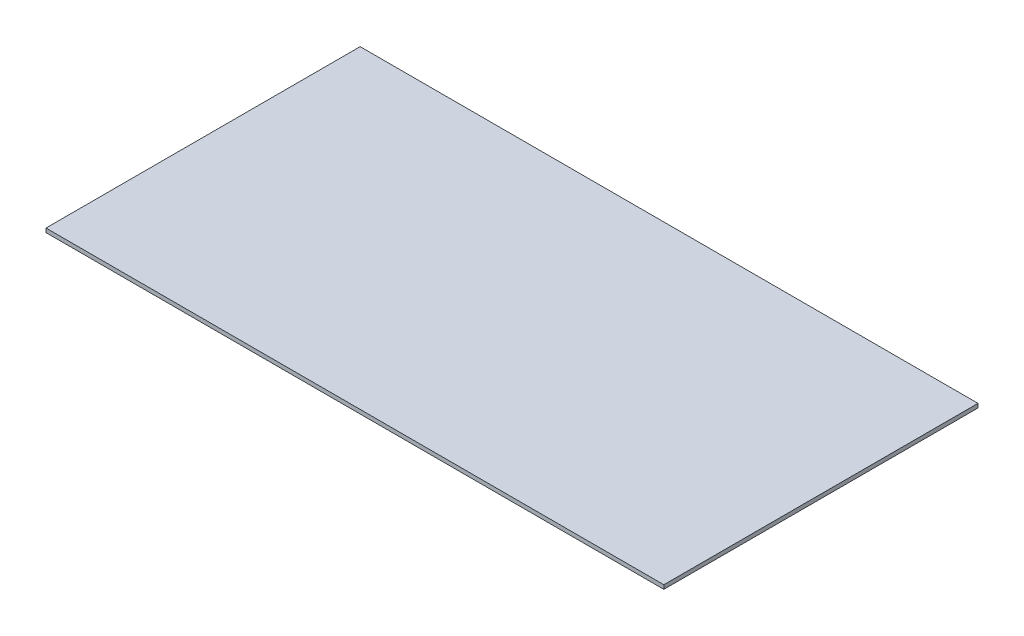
ISO-10303-21;
HEADER;
FILE_DESCRIPTION(('STEP AP214'),'2;1');
FILE_NAME('part.step','',(''),(''),'','','');
FILE_SCHEMA(('AUTOMOTIVE_DESIGN { 1 0 10303 214 1 1 1 1 }'));
ENDSEC;
DATA;
#1=APPLICATION_CONTEXT('core data for automotive mechanical design processes');
#2=APPLICATION_PROTOCOL_DEFINITION('international standard','automotive_design',2000,#1);
#3=PRODUCT_CONTEXT('',#1,'mechanical');
#4=PRODUCT('Part','Part','',(#3));
#5=PRODUCT_RELATED_PRODUCT_CATEGORY('part','',(#4));
#6=PRODUCT_DEFINITION_FORMATION('','',#4);
#7=PRODUCT_DEFINITION_CONTEXT('part definition',#1,'design');
#8=PRODUCT_DEFINITION('design','',#6,#7);
#9=PRODUCT_DEFINITION_SHAPE('','',#8);
#10=(LENGTH_UNIT() NAMED_UNIT(*) SI_UNIT(.MILLI.,.METRE.));
#11=(NAMED_UNIT(*) PLANE_ANGLE_UNIT() SI_UNIT($,.RADIAN.));
#12=(NAMED_UNIT(*) SI_UNIT($,.STERADIAN.) SOLID_ANGLE_UNIT());
#13=UNCERTAINTY_MEASURE_WITH_UNIT(LENGTH_MEASURE(1.E-05),#10,'distance_accuracy_value','');
#14=(GEOMETRIC_REPRESENTATION_CONTEXT(3) GLOBAL_UNCERTAINTY_ASSIGNED_CONTEXT((#13)) GLOBAL_UNIT_ASSIGNED_CONTEXT((#10,
#11,#12)) REPRESENTATION_CONTEXT('',''));
#15=CARTESIAN_POINT('',(0.,0.,0.));
#16=DIRECTION('',(0.,0.,1.));
#17=DIRECTION('',(1.,0.,0.));
#18=AXIS2_PLACEMENT_3D('',#15,#16,#17);
#19=CARTESIAN_POINT('',(-1431.63887067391,20.,-757.647064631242));
#20=DIRECTION('',(1.,0.,0.));
#21=DIRECTION('',(0.,0.,-1.));
#22=AXIS2_PLACEMENT_3D('',#19,#20,#21);
#23=PLANE('',#22);
#24=DIRECTION('',(0.,0.,1.));
#25=VECTOR('',#24,1.);
#26=CARTESIAN_POINT('',(-1431.63887067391,0.,-757.647064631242));
#27=LINE('',#26,#25);
#28=CARTESIAN_POINT('',(-1431.63887067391,0.,-757.647064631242));
#29=VERTEX_POINT('',#28);
#30=CARTESIAN_POINT('',(-1431.63887067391,0.,810.645635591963));
#31=VERTEX_POINT('',#30);
#32=EDGE_CURVE('E96',#29,#31,#27,.T.);
#33=ORIENTED_EDGE('',*,*,#32,.T.);
#34=DIRECTION('',(0.,-1.,0.));
#35=VECTOR('',#34,1.);
#36=CARTESIAN_POINT('',(-1431.63887067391,20.,810.645635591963));
#37=LINE('',#36,#35);
#38=CARTESIAN_POINT('',(-1431.63887067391,20.,810.645635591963));
#39=VERTEX_POINT('',#38);
#40=EDGE_CURVE('E11',#39,#31,#37,.T.);
#41=ORIENTED_EDGE('',*,*,#40,.F.);
#42=DIRECTION('',(0.,0.,1.));
#43=VECTOR('',#42,1.);
#44=CARTESIAN_POINT('',(-1431.63887067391,20.,-757.647064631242));
#45=LINE('',#44,#43);
#46=CARTESIAN_POINT('',(-1431.63887067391,20.,-757.647064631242));
#47=VERTEX_POINT('',#46);
#48=EDGE_CURVE('E84',#47,#39,#45,.T.);
#49=ORIENTED_EDGE('',*,*,#48,.F.);
#50=DIRECTION('',(0.,-1.,0.));
#51=VECTOR('',#50,1.);
#52=CARTESIAN_POINT('',(-1431.63887067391,20.,-757.647064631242));
#53=LINE('',#52,#51);
#54=EDGE_CURVE('E92',#47,#29,#53,.T.);
#55=ORIENTED_EDGE('',*,*,#54,.T.);
#56=EDGE_LOOP('',(#33,#41,#49,#55));
#57=FACE_BOUND('',#56,.T.);
#58=ADVANCED_FACE('F33',(#57),#23,.F.);
#59=CARTESIAN_POINT('',(-1431.63887067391,20.,810.645635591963));
#60=DIRECTION('',(0.,0.,-1.));
#61=DIRECTION('',(-1.,0.,0.));
#62=AXIS2_PLACEMENT_3D('',#59,#60,#61);
#63=PLANE('',#62);
#64=DIRECTION('',(1.,0.,0.));
#65=VECTOR('',#64,1.);
#66=CARTESIAN_POINT('',(-1431.63887067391,0.,810.645635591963));
#67=LINE('',#66,#65);
#68=CARTESIAN_POINT('',(1652.7280191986,0.,810.645635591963));
#69=VERTEX_POINT('',#68);
#70=EDGE_CURVE('E88',#31,#69,#67,.T.);
#71=ORIENTED_EDGE('',*,*,#70,.T.);
#72=DIRECTION('',(0.,-1.,0.));
#73=VECTOR('',#72,1.);
#74=CARTESIAN_POINT('',(1652.7280191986,20.,810.645635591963));
#75=LINE('',#74,#73);
#76=CARTESIAN_POINT('',(1652.7280191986,20.,810.645635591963));
#77=VERTEX_POINT('',#76);
#78=EDGE_CURVE('E41',#77,#69,#75,.T.);
#79=ORIENTED_EDGE('',*,*,#78,.F.);
#80=DIRECTION('',(1.,0.,0.));
#81=VECTOR('',#80,1.);
#82=CARTESIAN_POINT('',(-1431.63887067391,20.,810.645635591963));
#83=LINE('',#82,#81);
#84=EDGE_CURVE('E79',#39,#77,#83,.T.);
#85=ORIENTED_EDGE('',*,*,#84,.F.);
#86=ORIENTED_EDGE('',*,*,#40,.T.);
#87=EDGE_LOOP('',(#71,#79,#85,#86));
#88=FACE_BOUND('',#87,.T.);
#89=ADVANCED_FACE('F87',(#88),#63,.F.);
#90=CARTESIAN_POINT('',(1652.7280191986,20.,-757.647064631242));
#91=DIRECTION('',(-1.,0.,0.));
#92=DIRECTION('',(0.,0.,1.));
#93=AXIS2_PLACEMENT_3D('',#90,#91,#92);
#94=PLANE('',#93);
#95=DIRECTION('',(0.,0.,-1.));
#96=VECTOR('',#95,1.);
#97=CARTESIAN_POINT('',(1652.7280191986,0.,-757.647064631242));
#98=LINE('',#97,#96);
#99=CARTESIAN_POINT('',(1652.7280191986,0.,-757.647064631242));
#100=VERTEX_POINT('',#99);
#101=EDGE_CURVE('E66',#69,#100,#98,.T.);
#102=ORIENTED_EDGE('',*,*,#101,.T.);
#103=DIRECTION('',(0.,-1.,0.));
#104=VECTOR('',#103,1.);
#105=CARTESIAN_POINT('',(1652.7280191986,20.,-757.647064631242));
#106=LINE('',#105,#104);
#107=CARTESIAN_POINT('',(1652.7280191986,20.,-757.647064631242));
#108=VERTEX_POINT('',#107);
#109=EDGE_CURVE('E89',#108,#100,#106,.T.);
#110=ORIENTED_EDGE('',*,*,#109,.F.);
#111=DIRECTION('',(0.,0.,-1.));
#112=VECTOR('',#111,1.);
#113=CARTESIAN_POINT('',(1652.7280191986,20.,-757.647064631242));
#114=LINE('',#113,#112);
#115=EDGE_CURVE('E82',#77,#108,#114,.T.);
#116=ORIENTED_EDGE('',*,*,#115,.F.);
#117=ORIENTED_EDGE('',*,*,#78,.T.);
#118=EDGE_LOOP('',(#102,#110,#116,#117));
#119=FACE_BOUND('',#118,.T.);
#120=ADVANCED_FACE('F90',(#119),#94,.F.);
#121=CARTESIAN_POINT('',(-1431.63887067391,20.,-757.647064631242));
#122=DIRECTION('',(0.,0.,1.));
#123=DIRECTION('',(1.,0.,0.));
#124=AXIS2_PLACEMENT_3D('',#121,#122,#123);
#125=PLANE('',#124);
#126=DIRECTION('',(-1.,0.,0.));
#127=VECTOR('',#126,1.);
#128=CARTESIAN_POINT('',(-1431.63887067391,0.,-757.647064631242));
#129=LINE('',#128,#127);
#130=EDGE_CURVE('E72',#100,#29,#129,.T.);
#131=ORIENTED_EDGE('',*,*,#130,.T.);
#132=ORIENTED_EDGE('',*,*,#54,.F.);
#133=DIRECTION('',(-1.,0.,0.));
#134=VECTOR('',#133,1.);
#135=CARTESIAN_POINT('',(-1431.63887067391,20.,-757.647064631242));
#136=LINE('',#135,#134);
#137=EDGE_CURVE('E49',#108,#47,#136,.T.);
#138=ORIENTED_EDGE('',*,*,#137,.F.);
#139=ORIENTED_EDGE('',*,*,#109,.T.);
#140=EDGE_LOOP('',(#131,#132,#138,#139));
#141=FACE_BOUND('',#140,.T.);
#142=ADVANCED_FACE('F103',(#141),#125,.F.);
#143=CARTESIAN_POINT('',(0.,20.,0.));
#144=DIRECTION('',(0.,1.,0.));
#145=DIRECTION('',(0.,0.,1.));
#146=AXIS2_PLACEMENT_3D('',#143,#144,#145);
#147=PLANE('',#146);
#148=ORIENTED_EDGE('',*,*,#48,.T.);
#149=ORIENTED_EDGE('',*,*,#84,.T.);
#150=ORIENTED_EDGE('',*,*,#115,.T.);
#151=ORIENTED_EDGE('',*,*,#137,.T.);
#152=EDGE_LOOP('',(#148,#149,#150,#151));
#153=FACE_BOUND('',#152,.T.);
#154=ADVANCED_FACE('F80',(#153),#147,.T.);
#155=CARTESIAN_POINT('',(0.,0.,0.));
#156=DIRECTION('',(0.,1.,0.));
#157=DIRECTION('',(0.,0.,1.));
#158=AXIS2_PLACEMENT_3D('',#155,#156,#157);
#159=PLANE('',#158);
#160=ORIENTED_EDGE('',*,*,#32,.F.);
#161=ORIENTED_EDGE('',*,*,#130,.F.);
#162=ORIENTED_EDGE('',*,*,#101,.F.);
#163=ORIENTED_EDGE('',*,*,#70,.F.);
#164=EDGE_LOOP('',(#160,#161,#162,#163));
#165=FACE_BOUND('',#164,.T.);
#166=ADVANCED_FACE('F106',(#165),#159,.F.);
#167=CLOSED_SHELL('',(#58,#89,#120,#142,#154,#166));
#168=MANIFOLD_SOLID_BREP('B2',#167);
#169=ADVANCED_BREP_SHAPE_REPRESENTATION('',(#18,#168),#14);
#170=SHAPE_DEFINITION_REPRESENTATION(#9,#169);
ENDSEC;
END-ISO-10303-21;
